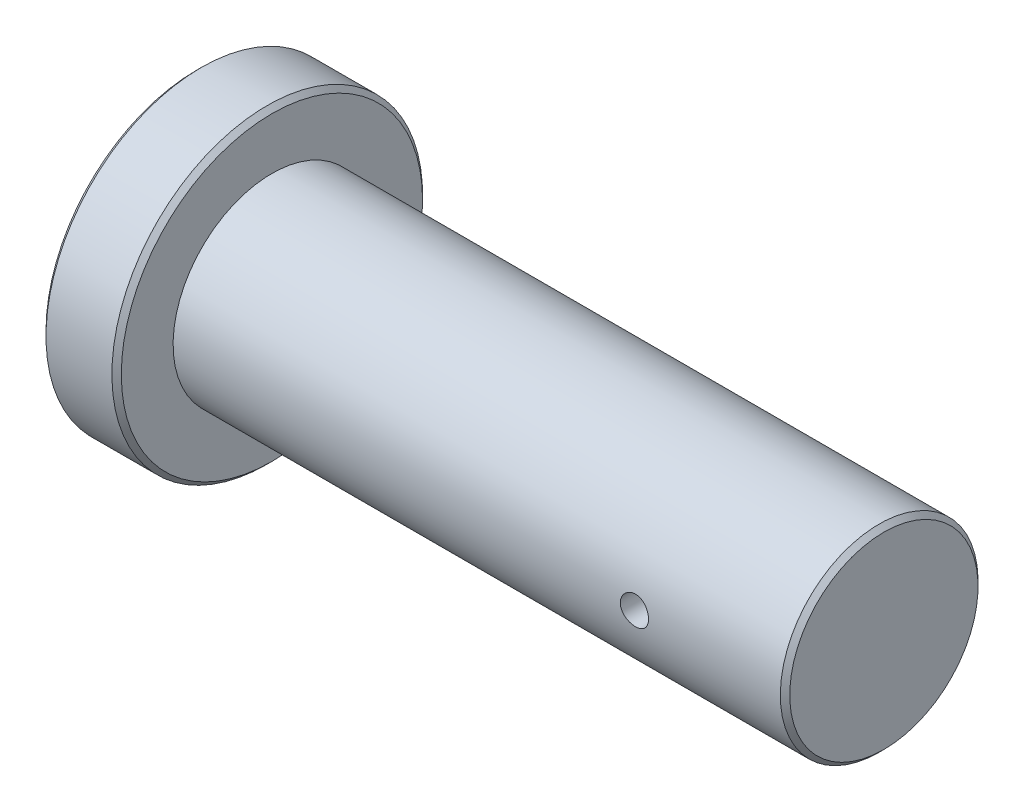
from build123d import *

# Parameters (mm, degrees)
SKETCH3_R          = 1.5
CUT_EXTRUDE1_DEPTH = 20
CHAMFER1_SIZE      = 0.5
SCALE1_SCALE       = 0.7
SCALE2_SCALE       = 0.5
SCALE3_SCALE       = 1.25


with BuildPart() as part:
    # Sketch2 → Revolve1 (revolve)
    with BuildSketch(Plane.XY, mode=Mode.PRIVATE) as revolve1_sk:
        Polygon((0, 0), (0, 16.5), (8, 16.5), (8, 10.5), (73, 10.5), (73, 0), align=None)
    revolve(revolve1_sk.sketch.rotate(Axis((0, 0, 0), (1, 0, 0)), 180), axis=Axis((0, 0, 0), (1, 0, 0)))

    # Sketch3 → Cut-Extrude1 (cut, symmetric)
    with BuildSketch(Plane.XY):
        with Locations((57, 0)):
            Circle(SKETCH3_R)
    extrude(amount=CUT_EXTRUDE1_DEPTH, both=True, mode=Mode.SUBTRACT)

    # Chamfer1
    chamfer1_edges = [part.edges().sort_by_distance(p)[0] for p in [
        (73, 10.5, 0),
        (8, 16.5, 0),
        (0, 16.5, 0),
    ]]
    chamfer(chamfer1_edges, length=CHAMFER1_SIZE)


with BuildPart() as part_1:
    # Scale1: scaled about (31.878760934, 8.67e-07, 0)
    add(part.part.scale(SCALE1_SCALE).moved(Location((9.56362828, 2.6e-07, 0))))


with BuildPart() as part_2:
    # Scale2: scaled about (31.878760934, 8.67e-07, 0)
    add(part_1.part.scale(SCALE2_SCALE).moved(Location((15.939380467, 4.34e-07, 0))))


with BuildPart() as part_3:
    # Scale3: scaled about (31.878760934, 8.67e-07, 0)
    add(part_2.part.scale(SCALE3_SCALE).moved(Location((-7.969690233, -2.17e-07, 0))))


solid = part_3.part
